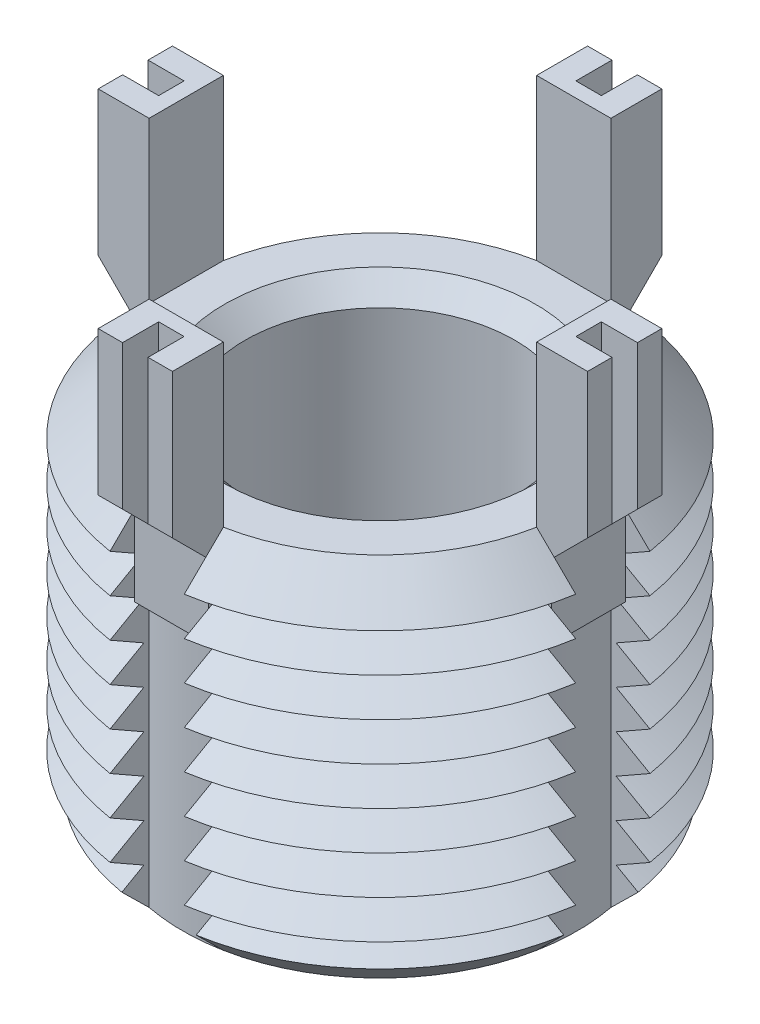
from build123d import *

# Parameters (mm, degrees)
SKETCH1_R               = 11.1125
BOSS_EXTRUDE1_DEPTH     = 17.272
CHAMFER1_SIZE           = 1.814
LPATTERN1_COUNT         = 8
LPATTERN1_PITCH         = 1.814
CUT_EXTRUDE1_REACH      = 25.352
CIRPATTERN1_COUNT       = 4
BOSS_EXTRUDE3_DEPTH     = 1.75
CIRPATTERN2_COUNT       = 4
CUT_EXTRUDE3_DEPTH      = 30.707213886
CUT_EXTRUDE3_DEPTH_BACK = 30.707213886
SKETCH6_W               = 1.7
SKETCH6_H               = 1.2
SKETCH6_W_2             = 1.2
SKETCH6_H_2             = 1.7
SKETCH7_R               = 6.35
CUT_EXTRUDE4_DEPTH      = 17.272
CHAMFER2_SIZE           = 0.977


with BuildPart() as part:
    # Sketch1 → Boss-Extrude1 (new body)
    with BuildSketch(Plane(origin=(0, 0, 0), x_dir=(1, 0, 0), z_dir=(0, 1, 0))):
        with Locations(Location((0, 0, 0), (0, 0, 270))):
            Circle(SKETCH1_R)
    extrude(amount=-BOSS_EXTRUDE1_DEPTH)

    # Chamfer1
    chamfer1_edges = [part.edges().sort_by_distance(p)[0] for p in [
        (0, 0, -11.1125),
        (0, -17.272, -11.1125),
    ]]
    chamfer(chamfer1_edges, length=CHAMFER1_SIZE)

    # Sketch3 → Cut-Revolve1 (revolve, cut)
    with BuildSketch(Plane(origin=(0, 0, 0), x_dir=(0, 0, -1), z_dir=(1, 0, 0))):
        Polygon((-11.1125, -1.814), (-9.541529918, -2.721), (-11.1125, -3.628), align=None)
    cut_revolve1 = revolve(axis=Axis((0, 0.885892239, 0), (0, -1, 0)), mode=Mode.SUBTRACT)

    # LPattern1: Cut-Revolve1 ×8
    with Locations(*[(0, -i * LPATTERN1_PITCH, 0) for i in range(1, LPATTERN1_COUNT)]):
        add(cut_revolve1, mode=Mode.SUBTRACT)

    # Cut-Extrude1: up to this cone (the profile starts inside it)
    cut_extrude1_end = Plane(origin=(0, 0, 0), z_dir=(0, 1, 0)).offset(-26.570499) * Cone(1e-06, 78.993, 78.992999, align=(Align.CENTER, Align.CENTER, Align.MIN), mode=Mode.PRIVATE)
    # Sketch4 → Cut-Extrude1 (cut, up to the surface)
    with BuildSketch(Plane(origin=(0, 0, 0), x_dir=(1, 0, 0), z_dir=(0, 1, 0)), mode=Mode.PRIVATE) as cut_extrude1_sk1:
        with BuildLine():
            Line((-9.132338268, 1.75), (-10.973839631, 1.75))
            ThreePointArc((-10.973839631, 1.75), (-11.1125, 0), (-10.973839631, -1.75))
            Line((-10.973839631, -1.75), (-9.132338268, -1.75))
            ThreePointArc((-9.132338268, -1.75), (-9.2985, 0), (-9.132338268, 1.75))
        make_face()
    cut_extrude1_tool1 = extrude(cut_extrude1_sk1.sketch, amount=-CUT_EXTRUDE1_REACH, mode=Mode.PRIVATE) & cut_extrude1_end
    cut_extrude1 = cut_extrude1_tool1.solids().sort_by_distance((-10.154651, 0, 0))[0]
    add(cut_extrude1, mode=Mode.SUBTRACT)

    # CirPattern1: Cut-Extrude1 ×4 about axis
    cirpattern1_axis = Axis((0, 0, 0), (0, 1, 0))
    for i in range(1, CIRPATTERN1_COUNT):
        add(cut_extrude1.rotate(cirpattern1_axis, i * 360 / CIRPATTERN1_COUNT), mode=Mode.SUBTRACT)

    # Sketch5 → Boss-Extrude3 (add, symmetric)
    with BuildSketch(Plane(origin=(0, 0, 0), x_dir=(0, 0, -1), z_dir=(1, 0, 0))):
        Polygon((-9.132338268, 7.558), (-9.132338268, -4.442), (-9.832338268, -4.442), (-9.832338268, -0.942), (-11.532338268, 0.758), (-11.532338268, 7.558), align=None)
    boss_extrude3 = extrude(amount=BOSS_EXTRUDE3_DEPTH, both=True)

    # CirPattern2: Boss-Extrude3 ×4 about axis
    cirpattern2_axis = Axis((0, 0, 0), (0, 1, 0))
    for i in range(1, CIRPATTERN2_COUNT):
        add(boss_extrude3.rotate(cirpattern2_axis, i * 360 / CIRPATTERN2_COUNT))

    # Sketch6 → Cut-Extrude3 (cut, two sides: drawn at the far end of the back side and taken through both)
    with BuildSketch(Plane(origin=(0, 7.558, 0), x_dir=(1, 0, 0), z_dir=(0, 1, 0)).offset(-CUT_EXTRUDE3_DEPTH_BACK)):
        with Locations((-10.682338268, 0)):
            Rectangle(SKETCH6_W, SKETCH6_H)
        with Locations((0, 10.682338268)):
            Rectangle(SKETCH6_W_2, SKETCH6_H_2)
        with Locations((10.682338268, 0)):
            Rectangle(SKETCH6_W, SKETCH6_H)
        with Locations((0, -10.682338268)):
            Rectangle(SKETCH6_W_2, SKETCH6_H_2)
    extrude(amount=CUT_EXTRUDE3_DEPTH + CUT_EXTRUDE3_DEPTH_BACK, mode=Mode.SUBTRACT)

    # Sketch7 → Cut-Extrude4 (cut)
    with BuildSketch(Plane(origin=(0, 0, 0), x_dir=(1, 0, 0), z_dir=(0, 1, 0))):
        with Locations(Location((0, 0, 0), (0, 0, 270))):
            Circle(SKETCH7_R)
    extrude(amount=-CUT_EXTRUDE4_DEPTH, mode=Mode.SUBTRACT)

    # Chamfer2
    chamfer2_edges = [part.edges().sort_by_distance(p)[0] for p in [
        (0, 0, -6.35),
        (0, -17.272, -6.35),
    ]]
    chamfer(chamfer2_edges, length=CHAMFER2_SIZE)


solid = part.part
